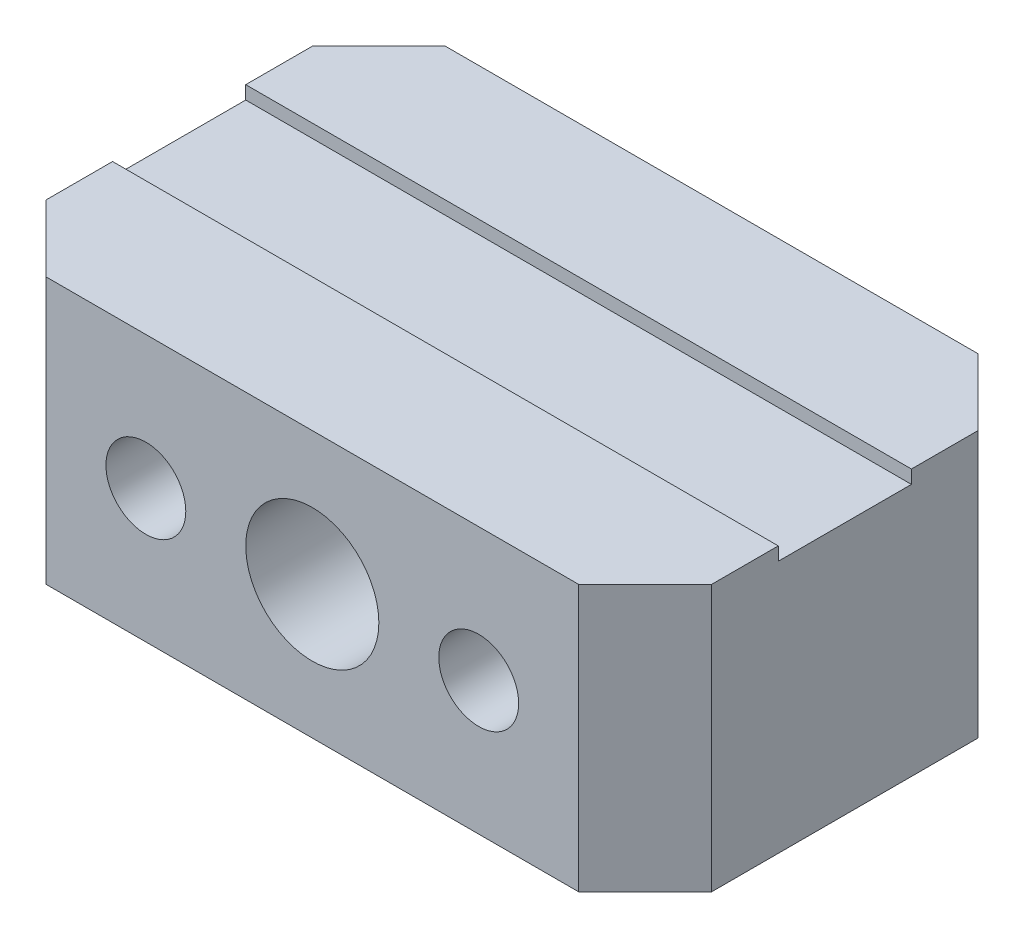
ISO-10303-21;
HEADER;
FILE_DESCRIPTION(('STEP AP214'),'2;1');
FILE_NAME('part.step','',(''),(''),'','','');
FILE_SCHEMA(('AUTOMOTIVE_DESIGN { 1 0 10303 214 1 1 1 1 }'));
ENDSEC;
DATA;
#1=APPLICATION_CONTEXT('core data for automotive mechanical design processes');
#2=APPLICATION_PROTOCOL_DEFINITION('international standard','automotive_design',2000,#1);
#3=PRODUCT_CONTEXT('',#1,'mechanical');
#4=PRODUCT('Part','Part','',(#3));
#5=PRODUCT_RELATED_PRODUCT_CATEGORY('part','',(#4));
#6=PRODUCT_DEFINITION_FORMATION('','',#4);
#7=PRODUCT_DEFINITION_CONTEXT('part definition',#1,'design');
#8=PRODUCT_DEFINITION('design','',#6,#7);
#9=PRODUCT_DEFINITION_SHAPE('','',#8);
#10=(LENGTH_UNIT() NAMED_UNIT(*) SI_UNIT(.MILLI.,.METRE.));
#11=(NAMED_UNIT(*) PLANE_ANGLE_UNIT() SI_UNIT($,.RADIAN.));
#12=(NAMED_UNIT(*) SI_UNIT($,.STERADIAN.) SOLID_ANGLE_UNIT());
#13=UNCERTAINTY_MEASURE_WITH_UNIT(LENGTH_MEASURE(1.E-05),#10,'distance_accuracy_value','');
#14=(GEOMETRIC_REPRESENTATION_CONTEXT(3) GLOBAL_UNCERTAINTY_ASSIGNED_CONTEXT((#13)) GLOBAL_UNIT_ASSIGNED_CONTEXT((#10,
#11,#12)) REPRESENTATION_CONTEXT('',''));
#15=CARTESIAN_POINT('',(0.,0.,0.));
#16=DIRECTION('',(0.,0.,1.));
#17=DIRECTION('',(1.,0.,0.));
#18=AXIS2_PLACEMENT_3D('',#15,#16,#17);
#19=CARTESIAN_POINT('',(-50.,20.,60.));
#20=DIRECTION('',(0.,-1.,0.));
#21=DIRECTION('',(0.,0.,-1.));
#22=AXIS2_PLACEMENT_3D('',#19,#20,#21);
#23=PLANE('',#22);
#24=DIRECTION('',(-1.,0.,0.));
#25=VECTOR('',#24,1.);
#26=CARTESIAN_POINT('',(-50.,20.,0.));
#27=LINE('',#26,#25);
#28=CARTESIAN_POINT('',(39.9999999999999,20.,0.));
#29=VERTEX_POINT('',#28);
#30=CARTESIAN_POINT('',(-40.,20.,0.));
#31=VERTEX_POINT('',#30);
#32=EDGE_CURVE('E176',#29,#31,#27,.T.);
#33=ORIENTED_EDGE('',*,*,#32,.T.);
#34=DIRECTION('',(0.707106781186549,0.,-0.707106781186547));
#35=VECTOR('',#34,1.);
#36=CARTESIAN_POINT('',(-50.,20.,10.));
#37=LINE('',#36,#35);
#38=CARTESIAN_POINT('',(-50.,20.,10.));
#39=VERTEX_POINT('',#38);
#40=EDGE_CURVE('E212',#31,#39,#37,.F.);
#41=ORIENTED_EDGE('',*,*,#40,.T.);
#42=DIRECTION('',(0.,0.,-1.));
#43=VECTOR('',#42,1.);
#44=CARTESIAN_POINT('',(-50.,20.,60.));
#45=LINE('',#44,#43);
#46=CARTESIAN_POINT('',(-50.,20.,20.));
#47=VERTEX_POINT('',#46);
#48=EDGE_CURVE('E178',#47,#39,#45,.T.);
#49=ORIENTED_EDGE('',*,*,#48,.F.);
#50=DIRECTION('',(-1.,0.,0.));
#51=VECTOR('',#50,1.);
#52=CARTESIAN_POINT('',(-50.,20.,20.));
#53=LINE('',#52,#51);
#54=CARTESIAN_POINT('',(50.,20.,20.));
#55=VERTEX_POINT('',#54);
#56=EDGE_CURVE('E141',#55,#47,#53,.T.);
#57=ORIENTED_EDGE('',*,*,#56,.F.);
#58=DIRECTION('',(0.,0.,-1.));
#59=VECTOR('',#58,1.);
#60=CARTESIAN_POINT('',(50.,20.,60.));
#61=LINE('',#60,#59);
#62=CARTESIAN_POINT('',(50.,20.,10.));
#63=VERTEX_POINT('',#62);
#64=EDGE_CURVE('E184',#55,#63,#61,.T.);
#65=ORIENTED_EDGE('',*,*,#64,.T.);
#66=DIRECTION('',(0.707106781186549,0.,0.707106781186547));
#67=VECTOR('',#66,1.);
#68=CARTESIAN_POINT('',(50.,20.,10.));
#69=LINE('',#68,#67);
#70=EDGE_CURVE('E210',#63,#29,#69,.F.);
#71=ORIENTED_EDGE('',*,*,#70,.T.);
#72=EDGE_LOOP('',(#33,#41,#49,#57,#65,#71));
#73=FACE_BOUND('',#72,.T.);
#74=ADVANCED_FACE('F31',(#73),#23,.F.);
#75=CARTESIAN_POINT('',(-50.,20.,60.));
#76=DIRECTION('',(1.,0.,0.));
#77=DIRECTION('',(0.,1.,0.));
#78=AXIS2_PLACEMENT_3D('',#75,#76,#77);
#79=PLANE('',#78);
#80=ORIENTED_EDGE('',*,*,#48,.T.);
#81=DIRECTION('',(0.,-1.,0.));
#82=VECTOR('',#81,1.);
#83=CARTESIAN_POINT('',(-50.,20.,10.));
#84=LINE('',#83,#82);
#85=CARTESIAN_POINT('',(-50.,-20.,10.));
#86=VERTEX_POINT('',#85);
#87=EDGE_CURVE('E195',#39,#86,#84,.T.);
#88=ORIENTED_EDGE('',*,*,#87,.T.);
#89=DIRECTION('',(0.,0.,-1.));
#90=VECTOR('',#89,1.);
#91=CARTESIAN_POINT('',(-50.,-20.,60.));
#92=LINE('',#91,#90);
#93=CARTESIAN_POINT('',(-50.,-20.,50.));
#94=VERTEX_POINT('',#93);
#95=EDGE_CURVE('E190',#94,#86,#92,.T.);
#96=ORIENTED_EDGE('',*,*,#95,.F.);
#97=DIRECTION('',(0.,1.,0.));
#98=VECTOR('',#97,1.);
#99=CARTESIAN_POINT('',(-50.,20.,50.));
#100=LINE('',#99,#98);
#101=CARTESIAN_POINT('',(-50.,20.,50.));
#102=VERTEX_POINT('',#101);
#103=EDGE_CURVE('E193',#94,#102,#100,.T.);
#104=ORIENTED_EDGE('',*,*,#103,.T.);
#105=CARTESIAN_POINT('',(-50.,20.,40.));
#106=VERTEX_POINT('',#105);
#107=EDGE_CURVE('E145',#102,#106,#45,.T.);
#108=ORIENTED_EDGE('',*,*,#107,.T.);
#109=DIRECTION('',(0.,1.,0.));
#110=VECTOR('',#109,1.);
#111=CARTESIAN_POINT('',(-50.,18.,40.));
#112=LINE('',#111,#110);
#113=CARTESIAN_POINT('',(-50.,18.,40.));
#114=VERTEX_POINT('',#113);
#115=EDGE_CURVE('E125',#114,#106,#112,.T.);
#116=ORIENTED_EDGE('',*,*,#115,.F.);
#117=DIRECTION('',(0.,0.,1.));
#118=VECTOR('',#117,1.);
#119=CARTESIAN_POINT('',(-50.,18.,20.));
#120=LINE('',#119,#118);
#121=CARTESIAN_POINT('',(-50.,18.,20.));
#122=VERTEX_POINT('',#121);
#123=EDGE_CURVE('E132',#122,#114,#120,.T.);
#124=ORIENTED_EDGE('',*,*,#123,.F.);
#125=DIRECTION('',(0.,1.,0.));
#126=VECTOR('',#125,1.);
#127=CARTESIAN_POINT('',(-50.,18.,20.));
#128=LINE('',#127,#126);
#129=EDGE_CURVE('E159',#122,#47,#128,.T.);
#130=ORIENTED_EDGE('',*,*,#129,.T.);
#131=EDGE_LOOP('',(#80,#88,#96,#104,#108,#116,#124,#130));
#132=FACE_BOUND('',#131,.T.);
#133=ADVANCED_FACE('F144',(#132),#79,.F.);
#134=CARTESIAN_POINT('',(-50.,-20.,60.));
#135=DIRECTION('',(0.,1.,0.));
#136=DIRECTION('',(0.,0.,1.));
#137=AXIS2_PLACEMENT_3D('',#134,#135,#136);
#138=PLANE('',#137);
#139=ORIENTED_EDGE('',*,*,#95,.T.);
#140=DIRECTION('',(-0.707106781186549,0.,0.707106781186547));
#141=VECTOR('',#140,1.);
#142=CARTESIAN_POINT('',(-50.,-20.,10.));
#143=LINE('',#142,#141);
#144=CARTESIAN_POINT('',(-40.,-20.,0.));
#145=VERTEX_POINT('',#144);
#146=EDGE_CURVE('E204',#86,#145,#143,.F.);
#147=ORIENTED_EDGE('',*,*,#146,.T.);
#148=DIRECTION('',(1.,0.,0.));
#149=VECTOR('',#148,1.);
#150=CARTESIAN_POINT('',(-50.,-20.,0.));
#151=LINE('',#150,#149);
#152=CARTESIAN_POINT('',(39.9999999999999,-20.,0.));
#153=VERTEX_POINT('',#152);
#154=EDGE_CURVE('E169',#145,#153,#151,.T.);
#155=ORIENTED_EDGE('',*,*,#154,.T.);
#156=DIRECTION('',(-0.707106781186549,0.,-0.707106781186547));
#157=VECTOR('',#156,1.);
#158=CARTESIAN_POINT('',(50.,-20.,10.));
#159=LINE('',#158,#157);
#160=CARTESIAN_POINT('',(50.,-20.,10.));
#161=VERTEX_POINT('',#160);
#162=EDGE_CURVE('E202',#153,#161,#159,.F.);
#163=ORIENTED_EDGE('',*,*,#162,.T.);
#164=DIRECTION('',(0.,0.,-1.));
#165=VECTOR('',#164,1.);
#166=CARTESIAN_POINT('',(50.,-20.,60.));
#167=LINE('',#166,#165);
#168=CARTESIAN_POINT('',(50.,-20.,50.));
#169=VERTEX_POINT('',#168);
#170=EDGE_CURVE('E187',#169,#161,#167,.T.);
#171=ORIENTED_EDGE('',*,*,#170,.F.);
#172=DIRECTION('',(-0.707106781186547,0.,0.707106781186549));
#173=VECTOR('',#172,1.);
#174=CARTESIAN_POINT('',(40.,-20.,60.));
#175=LINE('',#174,#173);
#176=CARTESIAN_POINT('',(40.,-20.,60.));
#177=VERTEX_POINT('',#176);
#178=EDGE_CURVE('E198',#169,#177,#175,.T.);
#179=ORIENTED_EDGE('',*,*,#178,.T.);
#180=DIRECTION('',(1.,0.,0.));
#181=VECTOR('',#180,1.);
#182=CARTESIAN_POINT('',(-50.,-20.,60.));
#183=LINE('',#182,#181);
#184=CARTESIAN_POINT('',(-40.,-20.,60.));
#185=VERTEX_POINT('',#184);
#186=EDGE_CURVE('E172',#185,#177,#183,.T.);
#187=ORIENTED_EDGE('',*,*,#186,.F.);
#188=DIRECTION('',(-0.707106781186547,0.,-0.707106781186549));
#189=VECTOR('',#188,1.);
#190=CARTESIAN_POINT('',(-40.,-20.,60.));
#191=LINE('',#190,#189);
#192=EDGE_CURVE('E200',#185,#94,#191,.T.);
#193=ORIENTED_EDGE('',*,*,#192,.T.);
#194=EDGE_LOOP('',(#139,#147,#155,#163,#171,#179,#187,#193));
#195=FACE_BOUND('',#194,.T.);
#196=ADVANCED_FACE('F231',(#195),#138,.F.);
#197=CARTESIAN_POINT('',(50.,20.,60.));
#198=DIRECTION('',(-1.,0.,0.));
#199=DIRECTION('',(0.,-1.,0.));
#200=AXIS2_PLACEMENT_3D('',#197,#198,#199);
#201=PLANE('',#200);
#202=ORIENTED_EDGE('',*,*,#170,.T.);
#203=DIRECTION('',(0.,1.,0.));
#204=VECTOR('',#203,1.);
#205=CARTESIAN_POINT('',(50.,20.,10.));
#206=LINE('',#205,#204);
#207=EDGE_CURVE('E216',#161,#63,#206,.T.);
#208=ORIENTED_EDGE('',*,*,#207,.T.);
#209=ORIENTED_EDGE('',*,*,#64,.F.);
#210=DIRECTION('',(0.,1.,0.));
#211=VECTOR('',#210,1.);
#212=CARTESIAN_POINT('',(50.,18.,20.));
#213=LINE('',#212,#211);
#214=CARTESIAN_POINT('',(50.,18.,20.));
#215=VERTEX_POINT('',#214);
#216=EDGE_CURVE('E147',#215,#55,#213,.T.);
#217=ORIENTED_EDGE('',*,*,#216,.F.);
#218=DIRECTION('',(0.,0.,-1.));
#219=VECTOR('',#218,1.);
#220=CARTESIAN_POINT('',(50.,18.,20.));
#221=LINE('',#220,#219);
#222=CARTESIAN_POINT('',(50.,18.,40.));
#223=VERTEX_POINT('',#222);
#224=EDGE_CURVE('E131',#223,#215,#221,.T.);
#225=ORIENTED_EDGE('',*,*,#224,.F.);
#226=DIRECTION('',(0.,1.,0.));
#227=VECTOR('',#226,1.);
#228=CARTESIAN_POINT('',(50.,18.,40.));
#229=LINE('',#228,#227);
#230=CARTESIAN_POINT('',(50.,20.,40.));
#231=VERTEX_POINT('',#230);
#232=EDGE_CURVE('E128',#223,#231,#229,.T.);
#233=ORIENTED_EDGE('',*,*,#232,.T.);
#234=CARTESIAN_POINT('',(50.,20.,50.));
#235=VERTEX_POINT('',#234);
#236=EDGE_CURVE('E185',#235,#231,#61,.T.);
#237=ORIENTED_EDGE('',*,*,#236,.F.);
#238=DIRECTION('',(0.,-1.,0.));
#239=VECTOR('',#238,1.);
#240=CARTESIAN_POINT('',(50.,-20.,50.));
#241=LINE('',#240,#239);
#242=EDGE_CURVE('E214',#235,#169,#241,.T.);
#243=ORIENTED_EDGE('',*,*,#242,.T.);
#244=EDGE_LOOP('',(#202,#208,#209,#217,#225,#233,#237,#243));
#245=FACE_BOUND('',#244,.T.);
#246=ADVANCED_FACE('F226',(#245),#201,.F.);
#247=ORIENTED_EDGE('',*,*,#107,.F.);
#248=DIRECTION('',(0.707106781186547,0.,0.707106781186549));
#249=VECTOR('',#248,1.);
#250=CARTESIAN_POINT('',(-40.,20.,60.));
#251=LINE('',#250,#249);
#252=CARTESIAN_POINT('',(-40.,20.,60.));
#253=VERTEX_POINT('',#252);
#254=EDGE_CURVE('E11',#102,#253,#251,.T.);
#255=ORIENTED_EDGE('',*,*,#254,.T.);
#256=DIRECTION('',(-1.,0.,0.));
#257=VECTOR('',#256,1.);
#258=CARTESIAN_POINT('',(-50.,20.,60.));
#259=LINE('',#258,#257);
#260=CARTESIAN_POINT('',(40.,20.,60.));
#261=VERTEX_POINT('',#260);
#262=EDGE_CURVE('E175',#261,#253,#259,.T.);
#263=ORIENTED_EDGE('',*,*,#262,.F.);
#264=DIRECTION('',(0.707106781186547,0.,-0.707106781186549));
#265=VECTOR('',#264,1.);
#266=CARTESIAN_POINT('',(40.,20.,60.));
#267=LINE('',#266,#265);
#268=EDGE_CURVE('E39',#261,#235,#267,.T.);
#269=ORIENTED_EDGE('',*,*,#268,.T.);
#270=ORIENTED_EDGE('',*,*,#236,.T.);
#271=DIRECTION('',(1.,0.,0.));
#272=VECTOR('',#271,1.);
#273=CARTESIAN_POINT('',(-50.,20.,40.));
#274=LINE('',#273,#272);
#275=EDGE_CURVE('E260',#106,#231,#274,.T.);
#276=ORIENTED_EDGE('',*,*,#275,.F.);
#277=EDGE_LOOP('',(#247,#255,#263,#269,#270,#276));
#278=FACE_BOUND('',#277,.T.);
#279=ADVANCED_FACE('F224',(#278),#23,.F.);
#280=CARTESIAN_POINT('',(-50.,-20.,60.));
#281=DIRECTION('',(0.,0.,1.));
#282=DIRECTION('',(1.,0.,0.));
#283=AXIS2_PLACEMENT_3D('',#280,#281,#282);
#284=PLANE('',#283);
#285=CARTESIAN_POINT('',(25.,0.,60.));
#286=DIRECTION('',(0.,0.,1.));
#287=DIRECTION('',(1.,0.,0.));
#288=AXIS2_PLACEMENT_3D('',#285,#286,#287);
#289=CIRCLE('',#288,6.);
#290=CARTESIAN_POINT('',(31.,0.,60.));
#291=VERTEX_POINT('',#290);
#292=EDGE_CURVE('E156',#291,#291,#289,.T.);
#293=ORIENTED_EDGE('',*,*,#292,.F.);
#294=EDGE_LOOP('',(#293));
#295=FACE_BOUND('',#294,.T.);
#296=CARTESIAN_POINT('',(-25.,0.,60.));
#297=DIRECTION('',(0.,0.,1.));
#298=DIRECTION('',(1.,0.,0.));
#299=AXIS2_PLACEMENT_3D('',#296,#297,#298);
#300=CIRCLE('',#299,6.);
#301=CARTESIAN_POINT('',(-19.,0.,60.));
#302=VERTEX_POINT('',#301);
#303=EDGE_CURVE('E155',#302,#302,#300,.T.);
#304=ORIENTED_EDGE('',*,*,#303,.F.);
#305=EDGE_LOOP('',(#304));
#306=FACE_BOUND('',#305,.T.);
#307=CARTESIAN_POINT('',(0.,0.,60.));
#308=DIRECTION('',(0.,0.,1.));
#309=DIRECTION('',(1.,0.,0.));
#310=AXIS2_PLACEMENT_3D('',#307,#308,#309);
#311=CIRCLE('',#310,10.);
#312=CARTESIAN_POINT('',(10.,0.,60.));
#313=VERTEX_POINT('',#312);
#314=EDGE_CURVE('E163',#313,#313,#311,.T.);
#315=ORIENTED_EDGE('',*,*,#314,.F.);
#316=EDGE_LOOP('',(#315));
#317=FACE_BOUND('',#316,.T.);
#318=ORIENTED_EDGE('',*,*,#262,.T.);
#319=DIRECTION('',(0.,-1.,0.));
#320=VECTOR('',#319,1.);
#321=CARTESIAN_POINT('',(-40.,-20.,60.));
#322=LINE('',#321,#320);
#323=EDGE_CURVE('E221',#253,#185,#322,.T.);
#324=ORIENTED_EDGE('',*,*,#323,.T.);
#325=ORIENTED_EDGE('',*,*,#186,.T.);
#326=DIRECTION('',(0.,1.,0.));
#327=VECTOR('',#326,1.);
#328=CARTESIAN_POINT('',(40.,20.,60.));
#329=LINE('',#328,#327);
#330=EDGE_CURVE('E219',#177,#261,#329,.T.);
#331=ORIENTED_EDGE('',*,*,#330,.T.);
#332=EDGE_LOOP('',(#318,#324,#325,#331));
#333=FACE_BOUND('',#332,.T.);
#334=ADVANCED_FACE('F233',(#295,#306,#317,#333),#284,.T.);
#335=CARTESIAN_POINT('',(-50.,-20.,0.));
#336=DIRECTION('',(0.,0.,1.));
#337=DIRECTION('',(1.,0.,0.));
#338=AXIS2_PLACEMENT_3D('',#335,#336,#337);
#339=PLANE('',#338);
#340=CARTESIAN_POINT('',(25.,0.,0.));
#341=DIRECTION('',(0.,0.,1.));
#342=DIRECTION('',(1.,0.,0.));
#343=AXIS2_PLACEMENT_3D('',#340,#341,#342);
#344=CIRCLE('',#343,6.);
#345=CARTESIAN_POINT('',(31.,0.,0.));
#346=VERTEX_POINT('',#345);
#347=EDGE_CURVE('E152',#346,#346,#344,.T.);
#348=ORIENTED_EDGE('',*,*,#347,.T.);
#349=EDGE_LOOP('',(#348));
#350=FACE_BOUND('',#349,.T.);
#351=CARTESIAN_POINT('',(-25.,0.,0.));
#352=DIRECTION('',(0.,0.,1.));
#353=DIRECTION('',(1.,0.,0.));
#354=AXIS2_PLACEMENT_3D('',#351,#352,#353);
#355=CIRCLE('',#354,6.);
#356=CARTESIAN_POINT('',(-19.,0.,0.));
#357=VERTEX_POINT('',#356);
#358=EDGE_CURVE('E160',#357,#357,#355,.T.);
#359=ORIENTED_EDGE('',*,*,#358,.T.);
#360=EDGE_LOOP('',(#359));
#361=FACE_BOUND('',#360,.T.);
#362=CARTESIAN_POINT('',(0.,0.,0.));
#363=DIRECTION('',(0.,0.,1.));
#364=DIRECTION('',(1.,0.,0.));
#365=AXIS2_PLACEMENT_3D('',#362,#363,#364);
#366=CIRCLE('',#365,10.);
#367=CARTESIAN_POINT('',(10.,0.,0.));
#368=VERTEX_POINT('',#367);
#369=EDGE_CURVE('E166',#368,#368,#366,.T.);
#370=ORIENTED_EDGE('',*,*,#369,.T.);
#371=EDGE_LOOP('',(#370));
#372=FACE_BOUND('',#371,.T.);
#373=ORIENTED_EDGE('',*,*,#154,.F.);
#374=DIRECTION('',(0.,1.,0.));
#375=VECTOR('',#374,1.);
#376=CARTESIAN_POINT('',(-40.,-20.,0.));
#377=LINE('',#376,#375);
#378=EDGE_CURVE('E208',#145,#31,#377,.T.);
#379=ORIENTED_EDGE('',*,*,#378,.T.);
#380=ORIENTED_EDGE('',*,*,#32,.F.);
#381=DIRECTION('',(0.,-1.,0.));
#382=VECTOR('',#381,1.);
#383=CARTESIAN_POINT('',(39.9999999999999,-20.,0.));
#384=LINE('',#383,#382);
#385=EDGE_CURVE('E206',#29,#153,#384,.T.);
#386=ORIENTED_EDGE('',*,*,#385,.T.);
#387=EDGE_LOOP('',(#373,#379,#380,#386));
#388=FACE_BOUND('',#387,.T.);
#389=ADVANCED_FACE('F248',(#350,#361,#372,#388),#339,.F.);
#390=CARTESIAN_POINT('',(0.,0.,0.));
#391=DIRECTION('',(0.,0.,1.));
#392=DIRECTION('',(1.,0.,0.));
#393=AXIS2_PLACEMENT_3D('',#390,#391,#392);
#394=CYLINDRICAL_SURFACE('',#393,10.);
#395=ORIENTED_EDGE('',*,*,#369,.F.);
#396=EDGE_LOOP('',(#395));
#397=FACE_BOUND('',#396,.T.);
#398=ORIENTED_EDGE('',*,*,#314,.T.);
#399=EDGE_LOOP('',(#398));
#400=FACE_BOUND('',#399,.T.);
#401=ADVANCED_FACE('F334',(#397,#400),#394,.F.);
#402=CARTESIAN_POINT('',(-25.,0.,0.));
#403=DIRECTION('',(0.,0.,1.));
#404=DIRECTION('',(1.,0.,0.));
#405=AXIS2_PLACEMENT_3D('',#402,#403,#404);
#406=CYLINDRICAL_SURFACE('',#405,6.);
#407=ORIENTED_EDGE('',*,*,#358,.F.);
#408=EDGE_LOOP('',(#407));
#409=FACE_BOUND('',#408,.T.);
#410=ORIENTED_EDGE('',*,*,#303,.T.);
#411=EDGE_LOOP('',(#410));
#412=FACE_BOUND('',#411,.T.);
#413=ADVANCED_FACE('F274',(#409,#412),#406,.F.);
#414=CARTESIAN_POINT('',(25.,0.,0.));
#415=DIRECTION('',(0.,0.,1.));
#416=DIRECTION('',(1.,0.,0.));
#417=AXIS2_PLACEMENT_3D('',#414,#415,#416);
#418=CYLINDRICAL_SURFACE('',#417,6.);
#419=ORIENTED_EDGE('',*,*,#347,.F.);
#420=EDGE_LOOP('',(#419));
#421=FACE_BOUND('',#420,.T.);
#422=ORIENTED_EDGE('',*,*,#292,.T.);
#423=EDGE_LOOP('',(#422));
#424=FACE_BOUND('',#423,.T.);
#425=ADVANCED_FACE('F267',(#421,#424),#418,.F.);
#426=CARTESIAN_POINT('',(-50.,18.,20.));
#427=DIRECTION('',(0.,0.,-1.));
#428=DIRECTION('',(-1.,0.,0.));
#429=AXIS2_PLACEMENT_3D('',#426,#427,#428);
#430=PLANE('',#429);
#431=ORIENTED_EDGE('',*,*,#56,.T.);
#432=ORIENTED_EDGE('',*,*,#129,.F.);
#433=DIRECTION('',(-1.,0.,0.));
#434=VECTOR('',#433,1.);
#435=CARTESIAN_POINT('',(-50.,18.,20.));
#436=LINE('',#435,#434);
#437=EDGE_CURVE('E138',#215,#122,#436,.T.);
#438=ORIENTED_EDGE('',*,*,#437,.F.);
#439=ORIENTED_EDGE('',*,*,#216,.T.);
#440=EDGE_LOOP('',(#431,#432,#438,#439));
#441=FACE_BOUND('',#440,.T.);
#442=ADVANCED_FACE('F264',(#441),#430,.F.);
#443=CARTESIAN_POINT('',(-50.,18.,40.));
#444=DIRECTION('',(0.,0.,1.));
#445=DIRECTION('',(1.,0.,0.));
#446=AXIS2_PLACEMENT_3D('',#443,#444,#445);
#447=PLANE('',#446);
#448=ORIENTED_EDGE('',*,*,#275,.T.);
#449=ORIENTED_EDGE('',*,*,#232,.F.);
#450=DIRECTION('',(1.,0.,0.));
#451=VECTOR('',#450,1.);
#452=CARTESIAN_POINT('',(-50.,18.,40.));
#453=LINE('',#452,#451);
#454=EDGE_CURVE('E120',#114,#223,#453,.T.);
#455=ORIENTED_EDGE('',*,*,#454,.F.);
#456=ORIENTED_EDGE('',*,*,#115,.T.);
#457=EDGE_LOOP('',(#448,#449,#455,#456));
#458=FACE_BOUND('',#457,.T.);
#459=ADVANCED_FACE('F123',(#458),#447,.F.);
#460=CARTESIAN_POINT('',(-50.,18.,40.));
#461=DIRECTION('',(0.,1.,0.));
#462=DIRECTION('',(0.,0.,1.));
#463=AXIS2_PLACEMENT_3D('',#460,#461,#462);
#464=PLANE('',#463);
#465=ORIENTED_EDGE('',*,*,#123,.T.);
#466=ORIENTED_EDGE('',*,*,#454,.T.);
#467=ORIENTED_EDGE('',*,*,#224,.T.);
#468=ORIENTED_EDGE('',*,*,#437,.T.);
#469=EDGE_LOOP('',(#465,#466,#467,#468));
#470=FACE_BOUND('',#469,.T.);
#471=ADVANCED_FACE('F136',(#470),#464,.T.);
#472=CARTESIAN_POINT('',(-50.,20.,10.));
#473=DIRECTION('',(0.707106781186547,0.,0.707106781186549));
#474=DIRECTION('',(0.707106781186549,0.,-0.707106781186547));
#475=AXIS2_PLACEMENT_3D('',#472,#473,#474);
#476=PLANE('',#475);
#477=ORIENTED_EDGE('',*,*,#40,.F.);
#478=ORIENTED_EDGE('',*,*,#378,.F.);
#479=ORIENTED_EDGE('',*,*,#146,.F.);
#480=ORIENTED_EDGE('',*,*,#87,.F.);
#481=EDGE_LOOP('',(#477,#478,#479,#480));
#482=FACE_BOUND('',#481,.T.);
#483=ADVANCED_FACE('F243',(#482),#476,.F.);
#484=CARTESIAN_POINT('',(50.,20.,10.));
#485=DIRECTION('',(-0.707106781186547,0.,0.707106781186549));
#486=DIRECTION('',(0.707106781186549,0.,0.707106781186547));
#487=AXIS2_PLACEMENT_3D('',#484,#485,#486);
#488=PLANE('',#487);
#489=ORIENTED_EDGE('',*,*,#162,.F.);
#490=ORIENTED_EDGE('',*,*,#385,.F.);
#491=ORIENTED_EDGE('',*,*,#70,.F.);
#492=ORIENTED_EDGE('',*,*,#207,.F.);
#493=EDGE_LOOP('',(#489,#490,#491,#492));
#494=FACE_BOUND('',#493,.T.);
#495=ADVANCED_FACE('F252',(#494),#488,.F.);
#496=CARTESIAN_POINT('',(-40.,-20.,60.));
#497=DIRECTION('',(-0.707106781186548,0.,0.707106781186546));
#498=DIRECTION('',(0.707106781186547,0.,0.707106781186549));
#499=AXIS2_PLACEMENT_3D('',#496,#497,#498);
#500=PLANE('',#499);
#501=ORIENTED_EDGE('',*,*,#254,.F.);
#502=ORIENTED_EDGE('',*,*,#103,.F.);
#503=ORIENTED_EDGE('',*,*,#192,.F.);
#504=ORIENTED_EDGE('',*,*,#323,.F.);
#505=EDGE_LOOP('',(#501,#502,#503,#504));
#506=FACE_BOUND('',#505,.T.);
#507=ADVANCED_FACE('F236',(#506),#500,.T.);
#508=CARTESIAN_POINT('',(40.,-20.,60.));
#509=DIRECTION('',(0.707106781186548,0.,0.707106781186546));
#510=DIRECTION('',(0.707106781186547,0.,-0.707106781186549));
#511=AXIS2_PLACEMENT_3D('',#508,#509,#510);
#512=PLANE('',#511);
#513=ORIENTED_EDGE('',*,*,#178,.F.);
#514=ORIENTED_EDGE('',*,*,#242,.F.);
#515=ORIENTED_EDGE('',*,*,#268,.F.);
#516=ORIENTED_EDGE('',*,*,#330,.F.);
#517=EDGE_LOOP('',(#513,#514,#515,#516));
#518=FACE_BOUND('',#517,.T.);
#519=ADVANCED_FACE('F33',(#518),#512,.T.);
#520=CLOSED_SHELL('',(#74,#133,#196,#246,#279,#334,#389,#401,#413,#425,#442,#459,#471,#483,#495,
#507,#519));
#521=MANIFOLD_SOLID_BREP('B2',#520);
#522=ADVANCED_BREP_SHAPE_REPRESENTATION('',(#18,#521),#14);
#523=SHAPE_DEFINITION_REPRESENTATION(#9,#522);
ENDSEC;
END-ISO-10303-21;
